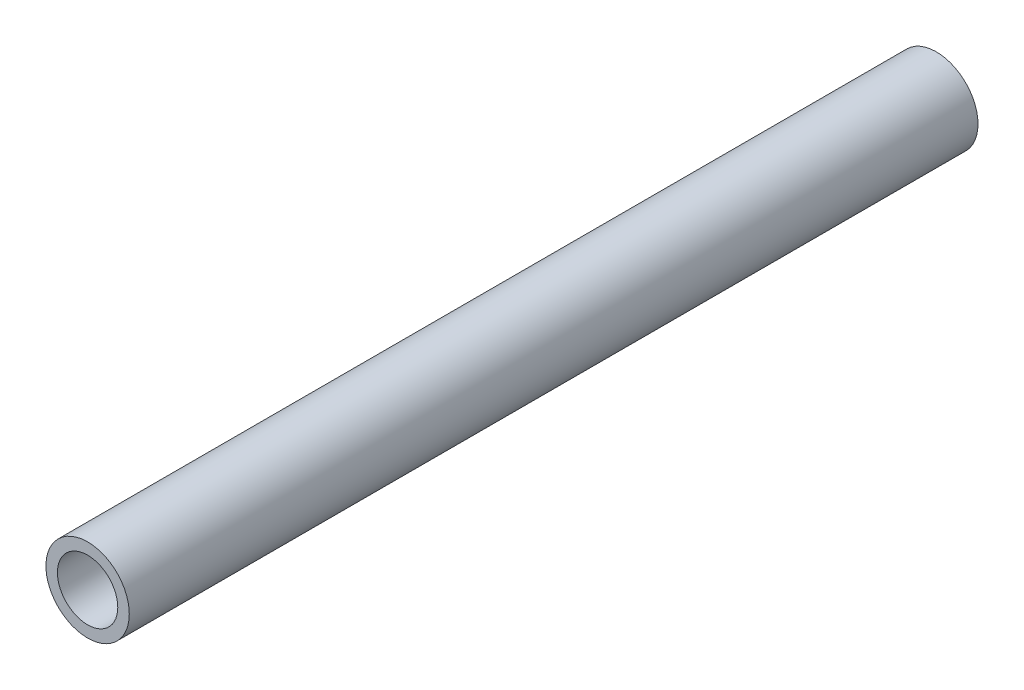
ISO-10303-21;
HEADER;
FILE_DESCRIPTION(('STEP AP214'),'2;1');
FILE_NAME('part.step','',(''),(''),'','','');
FILE_SCHEMA(('AUTOMOTIVE_DESIGN { 1 0 10303 214 1 1 1 1 }'));
ENDSEC;
DATA;
#1=APPLICATION_CONTEXT('core data for automotive mechanical design processes');
#2=APPLICATION_PROTOCOL_DEFINITION('international standard','automotive_design',2000,#1);
#3=PRODUCT_CONTEXT('',#1,'mechanical');
#4=PRODUCT('Part','Part','',(#3));
#5=PRODUCT_RELATED_PRODUCT_CATEGORY('part','',(#4));
#6=PRODUCT_DEFINITION_FORMATION('','',#4);
#7=PRODUCT_DEFINITION_CONTEXT('part definition',#1,'design');
#8=PRODUCT_DEFINITION('design','',#6,#7);
#9=PRODUCT_DEFINITION_SHAPE('','',#8);
#10=(LENGTH_UNIT() NAMED_UNIT(*) SI_UNIT(.MILLI.,.METRE.));
#11=(NAMED_UNIT(*) PLANE_ANGLE_UNIT() SI_UNIT($,.RADIAN.));
#12=(NAMED_UNIT(*) SI_UNIT($,.STERADIAN.) SOLID_ANGLE_UNIT());
#13=UNCERTAINTY_MEASURE_WITH_UNIT(LENGTH_MEASURE(1.E-05),#10,'distance_accuracy_value','');
#14=(GEOMETRIC_REPRESENTATION_CONTEXT(3) GLOBAL_UNCERTAINTY_ASSIGNED_CONTEXT((#13)) GLOBAL_UNIT_ASSIGNED_CONTEXT((#10,
#11,#12)) REPRESENTATION_CONTEXT('',''));
#15=CARTESIAN_POINT('',(0.,0.,0.));
#16=DIRECTION('',(0.,0.,1.));
#17=DIRECTION('',(1.,0.,0.));
#18=AXIS2_PLACEMENT_3D('',#15,#16,#17);
#19=CARTESIAN_POINT('',(0.,0.,32.));
#20=DIRECTION('',(0.,0.,1.));
#21=DIRECTION('',(1.,0.,0.));
#22=AXIS2_PLACEMENT_3D('',#19,#20,#21);
#23=PLANE('',#22);
#24=CARTESIAN_POINT('',(0.,0.,32.));
#25=DIRECTION('',(0.,0.,1.));
#26=DIRECTION('',(-1.,0.,0.));
#27=AXIS2_PLACEMENT_3D('',#24,#25,#26);
#28=CIRCLE('',#27,0.5334);
#29=CARTESIAN_POINT('',(0.5334,0.,32.));
#30=VERTEX_POINT('',#29);
#31=EDGE_CURVE('E64',#30,#30,#28,.T.);
#32=ORIENTED_EDGE('',*,*,#31,.F.);
#33=EDGE_LOOP('',(#32));
#34=FACE_BOUND('',#33,.T.);
#35=CARTESIAN_POINT('',(0.,0.,32.));
#36=DIRECTION('',(0.,0.,-1.));
#37=DIRECTION('',(-1.,0.,0.));
#38=AXIS2_PLACEMENT_3D('',#35,#36,#37);
#39=CIRCLE('',#38,0.7366);
#40=CARTESIAN_POINT('',(0.7366,0.,32.));
#41=VERTEX_POINT('',#40);
#42=EDGE_CURVE('E25',#41,#41,#39,.T.);
#43=ORIENTED_EDGE('',*,*,#42,.F.);
#44=EDGE_LOOP('',(#43));
#45=FACE_BOUND('',#44,.T.);
#46=ADVANCED_FACE('F17',(#34,#45),#23,.T.);
#47=CARTESIAN_POINT('',(0.,0.,17.5));
#48=DIRECTION('',(0.,0.,1.));
#49=DIRECTION('',(-1.,0.,0.));
#50=AXIS2_PLACEMENT_3D('',#47,#48,#49);
#51=CYLINDRICAL_SURFACE('',#50,0.7366);
#52=ORIENTED_EDGE('',*,*,#42,.T.);
#53=DIRECTION('',(0.,0.,-1.));
#54=VECTOR('',#53,1.);
#55=CARTESIAN_POINT('',(0.7366,0.,17.5));
#56=LINE('',#55,#54);
#57=CARTESIAN_POINT('',(0.7366,0.,17.));
#58=VERTEX_POINT('',#57);
#59=EDGE_CURVE('E11',#41,#58,#56,.T.);
#60=ORIENTED_EDGE('',*,*,#59,.T.);
#61=CARTESIAN_POINT('',(0.,0.,17.));
#62=DIRECTION('',(0.,0.,-1.));
#63=DIRECTION('',(-1.,0.,0.));
#64=AXIS2_PLACEMENT_3D('',#61,#62,#63);
#65=CIRCLE('',#64,0.7366);
#66=EDGE_CURVE('E53',#58,#58,#65,.T.);
#67=ORIENTED_EDGE('',*,*,#66,.F.);
#68=ORIENTED_EDGE('',*,*,#59,.F.);
#69=EDGE_LOOP('',(#52,#60,#67,#68));
#70=FACE_BOUND('',#69,.T.);
#71=ADVANCED_FACE('F52',(#70),#51,.T.);
#72=CARTESIAN_POINT('',(0.,0.,17.5));
#73=DIRECTION('',(0.,0.,1.));
#74=DIRECTION('',(-1.,0.,0.));
#75=AXIS2_PLACEMENT_3D('',#72,#73,#74);
#76=CYLINDRICAL_SURFACE('',#75,0.5334);
#77=ORIENTED_EDGE('',*,*,#31,.T.);
#78=DIRECTION('',(0.,0.,-1.));
#79=VECTOR('',#78,1.);
#80=CARTESIAN_POINT('',(0.5334,0.,17.5));
#81=LINE('',#80,#79);
#82=CARTESIAN_POINT('',(0.5334,0.,17.));
#83=VERTEX_POINT('',#82);
#84=EDGE_CURVE('E44',#30,#83,#81,.T.);
#85=ORIENTED_EDGE('',*,*,#84,.T.);
#86=CARTESIAN_POINT('',(0.,0.,17.));
#87=DIRECTION('',(0.,0.,1.));
#88=DIRECTION('',(-1.,0.,0.));
#89=AXIS2_PLACEMENT_3D('',#86,#87,#88);
#90=CIRCLE('',#89,0.5334);
#91=EDGE_CURVE('E58',#83,#83,#90,.T.);
#92=ORIENTED_EDGE('',*,*,#91,.F.);
#93=ORIENTED_EDGE('',*,*,#84,.F.);
#94=EDGE_LOOP('',(#77,#85,#92,#93));
#95=FACE_BOUND('',#94,.T.);
#96=ADVANCED_FACE('F91',(#95),#76,.F.);
#97=CARTESIAN_POINT('',(0.,0.,17.));
#98=DIRECTION('',(0.,0.,1.));
#99=DIRECTION('',(1.,0.,0.));
#100=AXIS2_PLACEMENT_3D('',#97,#98,#99);
#101=PLANE('',#100);
#102=ORIENTED_EDGE('',*,*,#91,.T.);
#103=EDGE_LOOP('',(#102));
#104=FACE_BOUND('',#103,.T.);
#105=ORIENTED_EDGE('',*,*,#66,.T.);
#106=EDGE_LOOP('',(#105));
#107=FACE_BOUND('',#106,.T.);
#108=ADVANCED_FACE('F56',(#104,#107),#101,.F.);
#109=CLOSED_SHELL('',(#46,#71,#96,#108));
#110=MANIFOLD_SOLID_BREP('B1',#109);
#111=ADVANCED_BREP_SHAPE_REPRESENTATION('',(#18,#110),#14);
#112=SHAPE_DEFINITION_REPRESENTATION(#9,#111);
ENDSEC;
END-ISO-10303-21;
